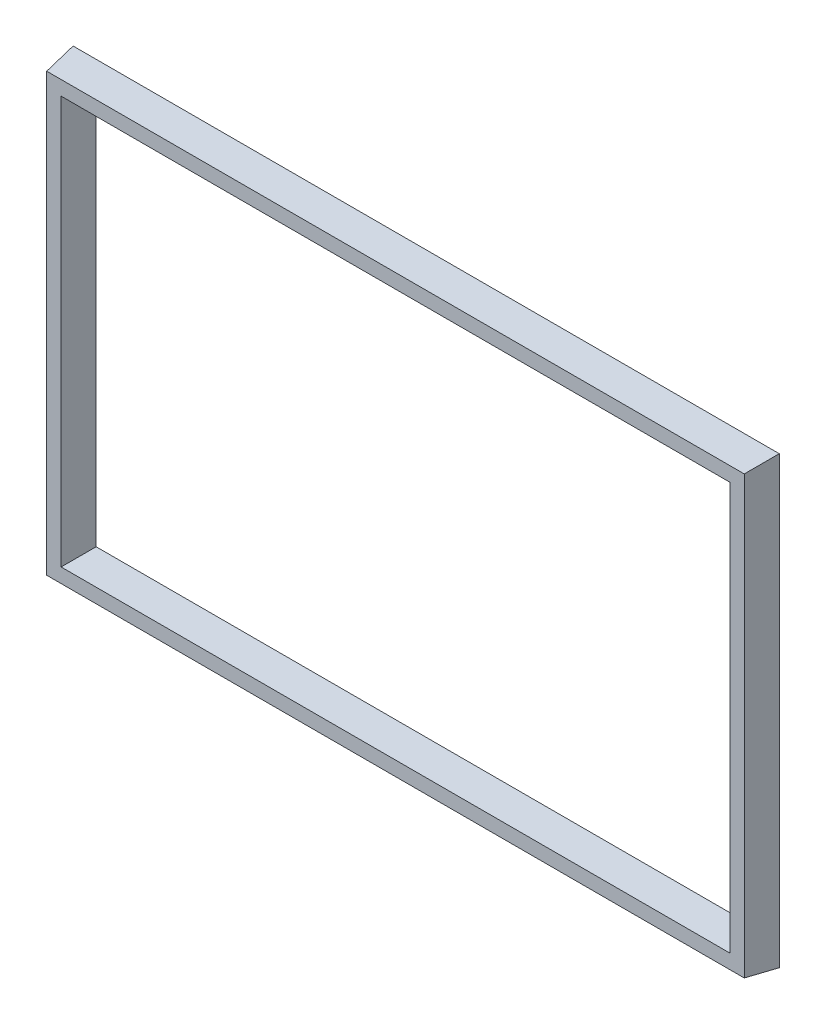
ISO-10303-21;
HEADER;
FILE_DESCRIPTION(('STEP AP214'),'2;1');
FILE_NAME('part.step','',(''),(''),'','','');
FILE_SCHEMA(('AUTOMOTIVE_DESIGN { 1 0 10303 214 1 1 1 1 }'));
ENDSEC;
DATA;
#1=APPLICATION_CONTEXT('core data for automotive mechanical design processes');
#2=APPLICATION_PROTOCOL_DEFINITION('international standard','automotive_design',2000,#1);
#3=PRODUCT_CONTEXT('',#1,'mechanical');
#4=PRODUCT('Part','Part','',(#3));
#5=PRODUCT_RELATED_PRODUCT_CATEGORY('part','',(#4));
#6=PRODUCT_DEFINITION_FORMATION('','',#4);
#7=PRODUCT_DEFINITION_CONTEXT('part definition',#1,'design');
#8=PRODUCT_DEFINITION('design','',#6,#7);
#9=PRODUCT_DEFINITION_SHAPE('','',#8);
#10=(LENGTH_UNIT() NAMED_UNIT(*) SI_UNIT(.MILLI.,.METRE.));
#11=(NAMED_UNIT(*) PLANE_ANGLE_UNIT() SI_UNIT($,.RADIAN.));
#12=(NAMED_UNIT(*) SI_UNIT($,.STERADIAN.) SOLID_ANGLE_UNIT());
#13=UNCERTAINTY_MEASURE_WITH_UNIT(LENGTH_MEASURE(1.E-05),#10,'distance_accuracy_value','');
#14=(GEOMETRIC_REPRESENTATION_CONTEXT(3) GLOBAL_UNCERTAINTY_ASSIGNED_CONTEXT((#13)) GLOBAL_UNIT_ASSIGNED_CONTEXT((#10,
#11,#12)) REPRESENTATION_CONTEXT('',''));
#15=CARTESIAN_POINT('',(0.,0.,0.));
#16=DIRECTION('',(0.,0.,1.));
#17=DIRECTION('',(1.,0.,0.));
#18=AXIS2_PLACEMENT_3D('',#15,#16,#17);
#19=CARTESIAN_POINT('',(0.,0.,2.));
#20=DIRECTION('',(0.,0.,1.));
#21=DIRECTION('',(1.,0.,0.));
#22=AXIS2_PLACEMENT_3D('',#19,#20,#21);
#23=PLANE('',#22);
#24=DIRECTION('',(-1.,0.,0.));
#25=VECTOR('',#24,1.);
#26=CARTESIAN_POINT('',(12.,-27.2189183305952,2.));
#27=LINE('',#26,#25);
#28=CARTESIAN_POINT('',(12.2810816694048,-27.2189183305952,2.));
#29=VERTEX_POINT('',#28);
#30=CARTESIAN_POINT('',(57.7189183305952,-27.2189183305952,2.));
#31=VERTEX_POINT('',#30);
#32=EDGE_CURVE('E139',#29,#31,#27,.F.);
#33=ORIENTED_EDGE('',*,*,#32,.T.);
#34=DIRECTION('',(0.,-1.,0.));
#35=VECTOR('',#34,1.);
#36=CARTESIAN_POINT('',(57.7189183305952,-27.5,2.));
#37=LINE('',#36,#35);
#38=CARTESIAN_POINT('',(57.7189183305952,1.21891833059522,2.));
#39=VERTEX_POINT('',#38);
#40=EDGE_CURVE('E161',#31,#39,#37,.F.);
#41=ORIENTED_EDGE('',*,*,#40,.T.);
#42=DIRECTION('',(1.,0.,0.));
#43=VECTOR('',#42,1.);
#44=CARTESIAN_POINT('',(58.,1.21891833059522,2.));
#45=LINE('',#44,#43);
#46=CARTESIAN_POINT('',(12.2810816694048,1.21891833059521,2.));
#47=VERTEX_POINT('',#46);
#48=EDGE_CURVE('E142',#39,#47,#45,.F.);
#49=ORIENTED_EDGE('',*,*,#48,.T.);
#50=DIRECTION('',(0.,1.,0.));
#51=VECTOR('',#50,1.);
#52=CARTESIAN_POINT('',(12.2810816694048,1.49999999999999,2.));
#53=LINE('',#52,#51);
#54=EDGE_CURVE('E135',#47,#29,#53,.F.);
#55=ORIENTED_EDGE('',*,*,#54,.T.);
#56=EDGE_LOOP('',(#33,#41,#49,#55));
#57=FACE_BOUND('',#56,.T.);
#58=DIRECTION('',(0.,1.,0.));
#59=VECTOR('',#58,1.);
#60=CARTESIAN_POINT('',(56.7810816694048,-26.,2.));
#61=LINE('',#60,#59);
#62=CARTESIAN_POINT('',(56.7810816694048,-26.2810816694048,2.));
#63=VERTEX_POINT('',#62);
#64=CARTESIAN_POINT('',(56.7810816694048,0.281081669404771,2.));
#65=VERTEX_POINT('',#64);
#66=EDGE_CURVE('E51',#63,#65,#61,.T.);
#67=ORIENTED_EDGE('',*,*,#66,.F.);
#68=DIRECTION('',(1.,0.,0.));
#69=VECTOR('',#68,1.);
#70=CARTESIAN_POINT('',(13.5,-26.2810816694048,2.));
#71=LINE('',#70,#69);
#72=CARTESIAN_POINT('',(13.2189183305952,-26.2810816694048,2.));
#73=VERTEX_POINT('',#72);
#74=EDGE_CURVE('E100',#73,#63,#71,.T.);
#75=ORIENTED_EDGE('',*,*,#74,.F.);
#76=DIRECTION('',(0.,-1.,0.));
#77=VECTOR('',#76,1.);
#78=CARTESIAN_POINT('',(13.2189183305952,0.,2.));
#79=LINE('',#78,#77);
#80=CARTESIAN_POINT('',(13.2189183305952,0.281081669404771,2.));
#81=VERTEX_POINT('',#80);
#82=EDGE_CURVE('E177',#81,#73,#79,.T.);
#83=ORIENTED_EDGE('',*,*,#82,.F.);
#84=DIRECTION('',(-1.,0.,0.));
#85=VECTOR('',#84,1.);
#86=CARTESIAN_POINT('',(56.5,0.281081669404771,2.));
#87=LINE('',#86,#85);
#88=EDGE_CURVE('E191',#65,#81,#87,.T.);
#89=ORIENTED_EDGE('',*,*,#88,.F.);
#90=EDGE_LOOP('',(#67,#75,#83,#89));
#91=FACE_BOUND('',#90,.T.);
#92=ADVANCED_FACE('F47',(#57,#91),#23,.T.);
#93=CARTESIAN_POINT('',(0.,0.,0.));
#94=DIRECTION('',(0.,0.,1.));
#95=DIRECTION('',(1.,0.,0.));
#96=AXIS2_PLACEMENT_3D('',#93,#94,#95);
#97=PLANE('',#96);
#98=DIRECTION('',(1.,0.,0.));
#99=VECTOR('',#98,1.);
#100=CARTESIAN_POINT('',(12.,-27.5,0.));
#101=LINE('',#100,#99);
#102=CARTESIAN_POINT('',(12.,-27.5,0.));
#103=VERTEX_POINT('',#102);
#104=CARTESIAN_POINT('',(58.,-27.5,0.));
#105=VERTEX_POINT('',#104);
#106=EDGE_CURVE('E181',#103,#105,#101,.T.);
#107=ORIENTED_EDGE('',*,*,#106,.F.);
#108=DIRECTION('',(0.,-1.,0.));
#109=VECTOR('',#108,1.);
#110=CARTESIAN_POINT('',(12.,1.49999999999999,0.));
#111=LINE('',#110,#109);
#112=CARTESIAN_POINT('',(12.,1.49999999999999,0.));
#113=VERTEX_POINT('',#112);
#114=EDGE_CURVE('E152',#113,#103,#111,.T.);
#115=ORIENTED_EDGE('',*,*,#114,.F.);
#116=DIRECTION('',(-1.,0.,0.));
#117=VECTOR('',#116,1.);
#118=CARTESIAN_POINT('',(58.,1.5,0.));
#119=LINE('',#118,#117);
#120=CARTESIAN_POINT('',(58.,1.5,0.));
#121=VERTEX_POINT('',#120);
#122=EDGE_CURVE('E167',#121,#113,#119,.T.);
#123=ORIENTED_EDGE('',*,*,#122,.F.);
#124=DIRECTION('',(0.,1.,0.));
#125=VECTOR('',#124,1.);
#126=CARTESIAN_POINT('',(58.,-27.5,0.));
#127=LINE('',#126,#125);
#128=EDGE_CURVE('E199',#105,#121,#127,.T.);
#129=ORIENTED_EDGE('',*,*,#128,.F.);
#130=EDGE_LOOP('',(#107,#115,#123,#129));
#131=FACE_BOUND('',#130,.T.);
#132=DIRECTION('',(1.,0.,0.));
#133=VECTOR('',#132,1.);
#134=CARTESIAN_POINT('',(13.5,-26.,0.));
#135=LINE('',#134,#133);
#136=CARTESIAN_POINT('',(13.5,-26.,0.));
#137=VERTEX_POINT('',#136);
#138=CARTESIAN_POINT('',(56.5,-26.,0.));
#139=VERTEX_POINT('',#138);
#140=EDGE_CURVE('E225',#137,#139,#135,.T.);
#141=ORIENTED_EDGE('',*,*,#140,.T.);
#142=DIRECTION('',(0.,1.,0.));
#143=VECTOR('',#142,1.);
#144=CARTESIAN_POINT('',(56.5,-26.,0.));
#145=LINE('',#144,#143);
#146=CARTESIAN_POINT('',(56.5,0.,0.));
#147=VERTEX_POINT('',#146);
#148=EDGE_CURVE('E222',#139,#147,#145,.T.);
#149=ORIENTED_EDGE('',*,*,#148,.T.);
#150=DIRECTION('',(-1.,0.,0.));
#151=VECTOR('',#150,1.);
#152=CARTESIAN_POINT('',(56.5,0.,0.));
#153=LINE('',#152,#151);
#154=CARTESIAN_POINT('',(13.5,0.,0.));
#155=VERTEX_POINT('',#154);
#156=EDGE_CURVE('E218',#147,#155,#153,.T.);
#157=ORIENTED_EDGE('',*,*,#156,.T.);
#158=DIRECTION('',(0.,-1.,0.));
#159=VECTOR('',#158,1.);
#160=CARTESIAN_POINT('',(13.5,0.,0.));
#161=LINE('',#160,#159);
#162=EDGE_CURVE('E189',#155,#137,#161,.T.);
#163=ORIENTED_EDGE('',*,*,#162,.T.);
#164=EDGE_LOOP('',(#141,#149,#157,#163));
#165=FACE_BOUND('',#164,.T.);
#166=ADVANCED_FACE('F212',(#131,#165),#97,.F.);
#167=CARTESIAN_POINT('',(12.,-27.5,0.));
#168=DIRECTION('',(0.,-0.99026806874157,0.139173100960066));
#169=DIRECTION('',(0.,-0.139173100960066,-0.99026806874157));
#170=AXIS2_PLACEMENT_3D('',#167,#168,#169);
#171=PLANE('',#170);
#172=ORIENTED_EDGE('',*,*,#106,.T.);
#173=DIRECTION('',(0.137844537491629,-0.137844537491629,-0.980814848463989));
#174=VECTOR('',#173,1.);
#175=CARTESIAN_POINT('',(58.,-27.5,0.));
#176=LINE('',#175,#174);
#177=EDGE_CURVE('E11',#31,#105,#176,.T.);
#178=ORIENTED_EDGE('',*,*,#177,.F.);
#179=ORIENTED_EDGE('',*,*,#32,.F.);
#180=DIRECTION('',(-0.137844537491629,-0.137844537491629,-0.980814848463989));
#181=VECTOR('',#180,1.);
#182=CARTESIAN_POINT('',(12.,-27.5,0.));
#183=LINE('',#182,#181);
#184=EDGE_CURVE('E147',#29,#103,#183,.T.);
#185=ORIENTED_EDGE('',*,*,#184,.T.);
#186=EDGE_LOOP('',(#172,#178,#179,#185));
#187=FACE_BOUND('',#186,.T.);
#188=ADVANCED_FACE('F159',(#187),#171,.T.);
#189=CARTESIAN_POINT('',(58.,-27.5,0.));
#190=DIRECTION('',(0.99026806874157,0.,0.139173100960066));
#191=DIRECTION('',(0.139173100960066,0.,-0.99026806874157));
#192=AXIS2_PLACEMENT_3D('',#189,#190,#191);
#193=PLANE('',#192);
#194=ORIENTED_EDGE('',*,*,#128,.T.);
#195=DIRECTION('',(0.137844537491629,0.137844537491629,-0.980814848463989));
#196=VECTOR('',#195,1.);
#197=CARTESIAN_POINT('',(58.,1.5,0.));
#198=LINE('',#197,#196);
#199=EDGE_CURVE('E58',#39,#121,#198,.T.);
#200=ORIENTED_EDGE('',*,*,#199,.F.);
#201=ORIENTED_EDGE('',*,*,#40,.F.);
#202=ORIENTED_EDGE('',*,*,#177,.T.);
#203=EDGE_LOOP('',(#194,#200,#201,#202));
#204=FACE_BOUND('',#203,.T.);
#205=ADVANCED_FACE('F240',(#204),#193,.T.);
#206=CARTESIAN_POINT('',(58.,1.5,0.));
#207=DIRECTION('',(0.,0.99026806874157,0.139173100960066));
#208=DIRECTION('',(0.,-0.139173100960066,0.99026806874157));
#209=AXIS2_PLACEMENT_3D('',#206,#207,#208);
#210=PLANE('',#209);
#211=ORIENTED_EDGE('',*,*,#122,.T.);
#212=DIRECTION('',(-0.137844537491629,0.137844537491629,-0.980814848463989));
#213=VECTOR('',#212,1.);
#214=CARTESIAN_POINT('',(12.,1.49999999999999,0.));
#215=LINE('',#214,#213);
#216=EDGE_CURVE('E157',#47,#113,#215,.T.);
#217=ORIENTED_EDGE('',*,*,#216,.F.);
#218=ORIENTED_EDGE('',*,*,#48,.F.);
#219=ORIENTED_EDGE('',*,*,#199,.T.);
#220=EDGE_LOOP('',(#211,#217,#218,#219));
#221=FACE_BOUND('',#220,.T.);
#222=ADVANCED_FACE('F209',(#221),#210,.T.);
#223=CARTESIAN_POINT('',(12.,1.49999999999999,0.));
#224=DIRECTION('',(-0.99026806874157,0.,0.139173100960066));
#225=DIRECTION('',(0.139173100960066,0.,0.99026806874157));
#226=AXIS2_PLACEMENT_3D('',#223,#224,#225);
#227=PLANE('',#226);
#228=ORIENTED_EDGE('',*,*,#114,.T.);
#229=ORIENTED_EDGE('',*,*,#184,.F.);
#230=ORIENTED_EDGE('',*,*,#54,.F.);
#231=ORIENTED_EDGE('',*,*,#216,.T.);
#232=EDGE_LOOP('',(#228,#229,#230,#231));
#233=FACE_BOUND('',#232,.T.);
#234=ADVANCED_FACE('F150',(#233),#227,.T.);
#235=CARTESIAN_POINT('',(13.5,-26.,0.));
#236=DIRECTION('',(0.,0.99026806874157,0.139173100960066));
#237=DIRECTION('',(0.,-0.139173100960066,0.99026806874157));
#238=AXIS2_PLACEMENT_3D('',#235,#236,#237);
#239=PLANE('',#238);
#240=ORIENTED_EDGE('',*,*,#140,.F.);
#241=DIRECTION('',(0.137844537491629,0.137844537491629,-0.980814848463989));
#242=VECTOR('',#241,1.);
#243=CARTESIAN_POINT('',(13.5,-26.,0.));
#244=LINE('',#243,#242);
#245=EDGE_CURVE('E174',#73,#137,#244,.T.);
#246=ORIENTED_EDGE('',*,*,#245,.F.);
#247=ORIENTED_EDGE('',*,*,#74,.T.);
#248=DIRECTION('',(-0.137844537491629,0.137844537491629,-0.980814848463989));
#249=VECTOR('',#248,1.);
#250=CARTESIAN_POINT('',(56.5,-26.,0.));
#251=LINE('',#250,#249);
#252=EDGE_CURVE('E178',#63,#139,#251,.T.);
#253=ORIENTED_EDGE('',*,*,#252,.T.);
#254=EDGE_LOOP('',(#240,#246,#247,#253));
#255=FACE_BOUND('',#254,.T.);
#256=ADVANCED_FACE('F229',(#255),#239,.T.);
#257=CARTESIAN_POINT('',(56.5,-26.,0.));
#258=DIRECTION('',(-0.99026806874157,0.,0.139173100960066));
#259=DIRECTION('',(0.139173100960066,0.,0.99026806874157));
#260=AXIS2_PLACEMENT_3D('',#257,#258,#259);
#261=PLANE('',#260);
#262=ORIENTED_EDGE('',*,*,#148,.F.);
#263=ORIENTED_EDGE('',*,*,#252,.F.);
#264=ORIENTED_EDGE('',*,*,#66,.T.);
#265=DIRECTION('',(-0.137844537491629,-0.137844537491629,-0.980814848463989));
#266=VECTOR('',#265,1.);
#267=CARTESIAN_POINT('',(56.5,0.,0.));
#268=LINE('',#267,#266);
#269=EDGE_CURVE('E182',#65,#147,#268,.T.);
#270=ORIENTED_EDGE('',*,*,#269,.T.);
#271=EDGE_LOOP('',(#262,#263,#264,#270));
#272=FACE_BOUND('',#271,.T.);
#273=ADVANCED_FACE('F249',(#272),#261,.T.);
#274=CARTESIAN_POINT('',(56.5,0.,0.));
#275=DIRECTION('',(0.,-0.99026806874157,0.139173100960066));
#276=DIRECTION('',(0.,-0.139173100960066,-0.99026806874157));
#277=AXIS2_PLACEMENT_3D('',#274,#275,#276);
#278=PLANE('',#277);
#279=ORIENTED_EDGE('',*,*,#156,.F.);
#280=ORIENTED_EDGE('',*,*,#269,.F.);
#281=ORIENTED_EDGE('',*,*,#88,.T.);
#282=DIRECTION('',(0.137844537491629,-0.137844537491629,-0.980814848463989));
#283=VECTOR('',#282,1.);
#284=CARTESIAN_POINT('',(13.5,0.,0.));
#285=LINE('',#284,#283);
#286=EDGE_CURVE('E70',#81,#155,#285,.T.);
#287=ORIENTED_EDGE('',*,*,#286,.T.);
#288=EDGE_LOOP('',(#279,#280,#281,#287));
#289=FACE_BOUND('',#288,.T.);
#290=ADVANCED_FACE('F251',(#289),#278,.T.);
#291=CARTESIAN_POINT('',(13.5,0.,0.));
#292=DIRECTION('',(0.99026806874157,0.,0.139173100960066));
#293=DIRECTION('',(0.139173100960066,0.,-0.99026806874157));
#294=AXIS2_PLACEMENT_3D('',#291,#292,#293);
#295=PLANE('',#294);
#296=ORIENTED_EDGE('',*,*,#162,.F.);
#297=ORIENTED_EDGE('',*,*,#286,.F.);
#298=ORIENTED_EDGE('',*,*,#82,.T.);
#299=ORIENTED_EDGE('',*,*,#245,.T.);
#300=EDGE_LOOP('',(#296,#297,#298,#299));
#301=FACE_BOUND('',#300,.T.);
#302=ADVANCED_FACE('F49',(#301),#295,.T.);
#303=CLOSED_SHELL('',(#92,#166,#188,#205,#222,#234,#256,#273,#290,#302));
#304=MANIFOLD_SOLID_BREP('B2',#303);
#305=ADVANCED_BREP_SHAPE_REPRESENTATION('',(#18,#304),#14);
#306=SHAPE_DEFINITION_REPRESENTATION(#9,#305);
ENDSEC;
END-ISO-10303-21;
